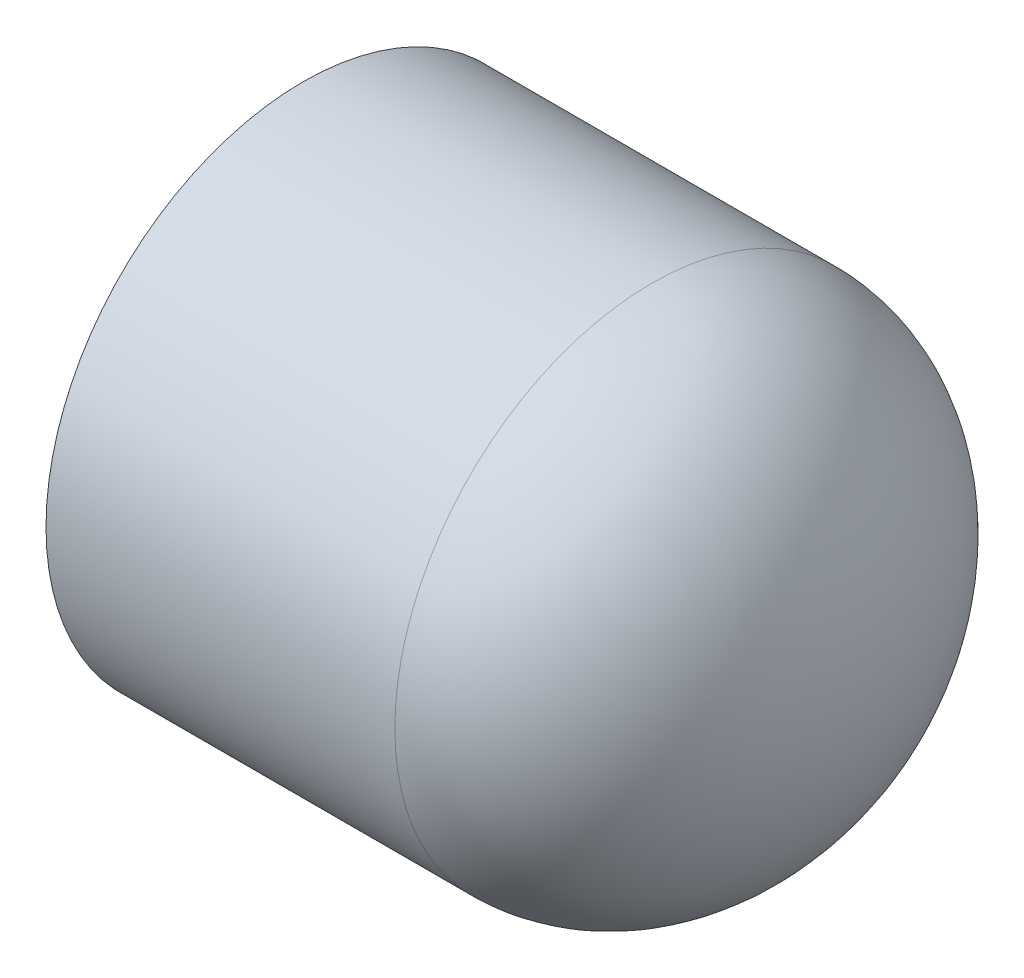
from build123d import *


with BuildPart() as part:
    # Sketch1 → Revolve1 (revolve)
    with BuildSketch(Plane.XY, mode=Mode.PRIVATE) as revolve1_sk:
        with BuildLine():
            Line((18.0594, 0), (22.0091, 0))
            add(Edge.make_bspline(
                [(5.9309, -20.5867), (22.0091, -20.5867), (22.0091, 0)],
                knots=[3.141592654, 3.141592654, 3.141592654, 4.71238898, 4.71238898, 4.71238898], degree=2, weights=[1, 0.707106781, 1]))
            Line((5.9309, -20.5867), (-22.0091, -20.5867))
            Line((-22.0091, -20.5867), (-22.0091, -16.8275))
            Line((-22.0091, -16.8275), (5.9309, -16.637))
            add(Edge.make_bspline(
                [(5.9309, -16.637), (18.0594, -16.637), (18.0594, 0)],
                knots=[0, 0, 0, 1.570796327, 1.570796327, 1.570796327], degree=2, weights=[1, 0.707106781, 1]))
        make_face()
    revolve(revolve1_sk.sketch.rotate(Axis((-22.0091, 0, 0), (1, 0, 0)), 270), axis=Axis((-22.0091, 0, 0), (1, 0, 0)))


solid = part.part
